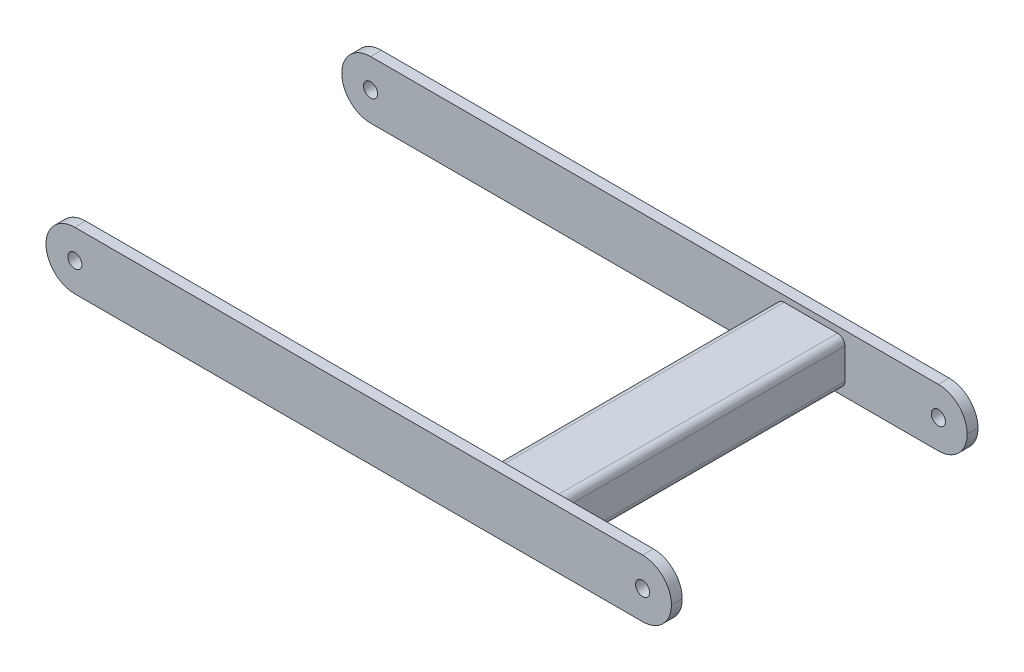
ISO-10303-21;
HEADER;
FILE_DESCRIPTION(('STEP AP214'),'2;1');
FILE_NAME('part.step','',(''),(''),'','','');
FILE_SCHEMA(('AUTOMOTIVE_DESIGN { 1 0 10303 214 1 1 1 1 }'));
ENDSEC;
DATA;
#1=APPLICATION_CONTEXT('core data for automotive mechanical design processes');
#2=APPLICATION_PROTOCOL_DEFINITION('international standard','automotive_design',2000,#1);
#3=PRODUCT_CONTEXT('',#1,'mechanical');
#4=PRODUCT('Part','Part','',(#3));
#5=PRODUCT_RELATED_PRODUCT_CATEGORY('part','',(#4));
#6=PRODUCT_DEFINITION_FORMATION('','',#4);
#7=PRODUCT_DEFINITION_CONTEXT('part definition',#1,'design');
#8=PRODUCT_DEFINITION('design','',#6,#7);
#9=PRODUCT_DEFINITION_SHAPE('','',#8);
#10=(LENGTH_UNIT() NAMED_UNIT(*) SI_UNIT(.MILLI.,.METRE.));
#11=(NAMED_UNIT(*) PLANE_ANGLE_UNIT() SI_UNIT($,.RADIAN.));
#12=(NAMED_UNIT(*) SI_UNIT($,.STERADIAN.) SOLID_ANGLE_UNIT());
#13=UNCERTAINTY_MEASURE_WITH_UNIT(LENGTH_MEASURE(1.E-05),#10,'distance_accuracy_value','');
#14=(GEOMETRIC_REPRESENTATION_CONTEXT(3) GLOBAL_UNCERTAINTY_ASSIGNED_CONTEXT((#13)) GLOBAL_UNIT_ASSIGNED_CONTEXT((#10,
#11,#12)) REPRESENTATION_CONTEXT('',''));
#15=CARTESIAN_POINT('',(0.,0.,0.));
#16=DIRECTION('',(0.,0.,1.));
#17=DIRECTION('',(1.,0.,0.));
#18=AXIS2_PLACEMENT_3D('',#15,#16,#17);
#19=CARTESIAN_POINT('',(389.5,13.5999999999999,125.475));
#20=DIRECTION('',(0.,0.,-1.));
#21=DIRECTION('',(-1.,0.,0.));
#22=AXIS2_PLACEMENT_3D('',#19,#20,#21);
#23=CYLINDRICAL_SURFACE('',#22,6.40000000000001);
#24=CARTESIAN_POINT('',(389.5,13.5999999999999,-125.475));
#25=DIRECTION('',(0.,0.,1.));
#26=DIRECTION('',(0.,1.,0.));
#27=AXIS2_PLACEMENT_3D('',#24,#25,#26);
#28=CIRCLE('',#27,6.40000000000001);
#29=CARTESIAN_POINT('',(389.5,20.,-125.475));
#30=VERTEX_POINT('',#29);
#31=CARTESIAN_POINT('',(383.1,13.5999999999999,-125.475));
#32=VERTEX_POINT('',#31);
#33=EDGE_CURVE('E247',#30,#32,#28,.T.);
#34=ORIENTED_EDGE('',*,*,#33,.T.);
#35=DIRECTION('',(0.,0.,-1.));
#36=VECTOR('',#35,1.);
#37=CARTESIAN_POINT('',(383.1,13.5999999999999,125.475));
#38=LINE('',#37,#36);
#39=CARTESIAN_POINT('',(383.1,13.5999999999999,125.475));
#40=VERTEX_POINT('',#39);
#41=EDGE_CURVE('E13',#40,#32,#38,.T.);
#42=ORIENTED_EDGE('',*,*,#41,.F.);
#43=CARTESIAN_POINT('',(389.5,13.5999999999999,125.475));
#44=DIRECTION('',(0.,0.,1.));
#45=DIRECTION('',(0.,1.,0.));
#46=AXIS2_PLACEMENT_3D('',#43,#44,#45);
#47=CIRCLE('',#46,6.40000000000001);
#48=CARTESIAN_POINT('',(389.5,20.,125.475));
#49=VERTEX_POINT('',#48);
#50=EDGE_CURVE('E325',#49,#40,#47,.T.);
#51=ORIENTED_EDGE('',*,*,#50,.F.);
#52=DIRECTION('',(0.,0.,-1.));
#53=VECTOR('',#52,1.);
#54=CARTESIAN_POINT('',(389.5,20.,125.475));
#55=LINE('',#54,#53);
#56=EDGE_CURVE('E262',#49,#30,#55,.T.);
#57=ORIENTED_EDGE('',*,*,#56,.T.);
#58=EDGE_LOOP('',(#34,#42,#51,#57));
#59=FACE_BOUND('',#58,.T.);
#60=ADVANCED_FACE('F75',(#59),#23,.T.);
#61=CARTESIAN_POINT('',(383.1,13.5999999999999,125.475));
#62=DIRECTION('',(1.,0.,0.));
#63=DIRECTION('',(0.,1.,0.));
#64=AXIS2_PLACEMENT_3D('',#61,#62,#63);
#65=PLANE('',#64);
#66=DIRECTION('',(0.,-1.,0.));
#67=VECTOR('',#66,1.);
#68=CARTESIAN_POINT('',(383.1,13.5999999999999,-125.475));
#69=LINE('',#68,#67);
#70=CARTESIAN_POINT('',(383.1,-13.6000000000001,-125.475));
#71=VERTEX_POINT('',#70);
#72=EDGE_CURVE('E250',#32,#71,#69,.T.);
#73=ORIENTED_EDGE('',*,*,#72,.T.);
#74=DIRECTION('',(0.,0.,-1.));
#75=VECTOR('',#74,1.);
#76=CARTESIAN_POINT('',(383.1,-13.6000000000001,125.475));
#77=LINE('',#76,#75);
#78=CARTESIAN_POINT('',(383.1,-13.6000000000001,125.475));
#79=VERTEX_POINT('',#78);
#80=EDGE_CURVE('E85',#79,#71,#77,.T.);
#81=ORIENTED_EDGE('',*,*,#80,.F.);
#82=DIRECTION('',(0.,-1.,0.));
#83=VECTOR('',#82,1.);
#84=CARTESIAN_POINT('',(383.1,13.5999999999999,125.475));
#85=LINE('',#84,#83);
#86=EDGE_CURVE('E327',#40,#79,#85,.T.);
#87=ORIENTED_EDGE('',*,*,#86,.F.);
#88=ORIENTED_EDGE('',*,*,#41,.T.);
#89=EDGE_LOOP('',(#73,#81,#87,#88));
#90=FACE_BOUND('',#89,.T.);
#91=ADVANCED_FACE('F362',(#90),#65,.F.);
#92=CARTESIAN_POINT('',(389.5,-13.6000000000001,125.475));
#93=DIRECTION('',(0.,0.,-1.));
#94=DIRECTION('',(-1.,0.,0.));
#95=AXIS2_PLACEMENT_3D('',#92,#93,#94);
#96=CYLINDRICAL_SURFACE('',#95,6.40000000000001);
#97=CARTESIAN_POINT('',(389.5,-13.6000000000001,-125.475));
#98=DIRECTION('',(0.,0.,1.));
#99=DIRECTION('',(0.,1.,0.));
#100=AXIS2_PLACEMENT_3D('',#97,#98,#99);
#101=CIRCLE('',#100,6.40000000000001);
#102=CARTESIAN_POINT('',(389.5,-20.0000000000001,-125.475));
#103=VERTEX_POINT('',#102);
#104=EDGE_CURVE('E252',#71,#103,#101,.T.);
#105=ORIENTED_EDGE('',*,*,#104,.T.);
#106=DIRECTION('',(0.,0.,-1.));
#107=VECTOR('',#106,1.);
#108=CARTESIAN_POINT('',(389.5,-20.0000000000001,125.475));
#109=LINE('',#108,#107);
#110=CARTESIAN_POINT('',(389.5,-20.0000000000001,125.475));
#111=VERTEX_POINT('',#110);
#112=EDGE_CURVE('E269',#111,#103,#109,.T.);
#113=ORIENTED_EDGE('',*,*,#112,.F.);
#114=CARTESIAN_POINT('',(389.5,-13.6000000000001,125.475));
#115=DIRECTION('',(0.,0.,1.));
#116=DIRECTION('',(0.,1.,0.));
#117=AXIS2_PLACEMENT_3D('',#114,#115,#116);
#118=CIRCLE('',#117,6.40000000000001);
#119=EDGE_CURVE('E329',#79,#111,#118,.T.);
#120=ORIENTED_EDGE('',*,*,#119,.F.);
#121=ORIENTED_EDGE('',*,*,#80,.T.);
#122=EDGE_LOOP('',(#105,#113,#120,#121));
#123=FACE_BOUND('',#122,.T.);
#124=ADVANCED_FACE('F367',(#123),#96,.T.);
#125=CARTESIAN_POINT('',(436.7,-20.,125.475));
#126=DIRECTION('',(0.,1.,0.));
#127=DIRECTION('',(-1.,0.,0.));
#128=AXIS2_PLACEMENT_3D('',#125,#126,#127);
#129=PLANE('',#128);
#130=DIRECTION('',(1.,0.,0.));
#131=VECTOR('',#130,1.);
#132=CARTESIAN_POINT('',(436.7,-20.,-125.475));
#133=LINE('',#132,#131);
#134=CARTESIAN_POINT('',(436.7,-20.,-125.475));
#135=VERTEX_POINT('',#134);
#136=EDGE_CURVE('E254',#103,#135,#133,.T.);
#137=ORIENTED_EDGE('',*,*,#136,.T.);
#138=DIRECTION('',(0.,0.,-1.));
#139=VECTOR('',#138,1.);
#140=CARTESIAN_POINT('',(436.7,-20.,125.475));
#141=LINE('',#140,#139);
#142=CARTESIAN_POINT('',(436.7,-20.,125.475));
#143=VERTEX_POINT('',#142);
#144=EDGE_CURVE('E266',#143,#135,#141,.T.);
#145=ORIENTED_EDGE('',*,*,#144,.F.);
#146=DIRECTION('',(1.,0.,0.));
#147=VECTOR('',#146,1.);
#148=CARTESIAN_POINT('',(436.7,-20.,125.475));
#149=LINE('',#148,#147);
#150=EDGE_CURVE('E331',#111,#143,#149,.T.);
#151=ORIENTED_EDGE('',*,*,#150,.F.);
#152=ORIENTED_EDGE('',*,*,#112,.T.);
#153=EDGE_LOOP('',(#137,#145,#151,#152));
#154=FACE_BOUND('',#153,.T.);
#155=ADVANCED_FACE('F337',(#154),#129,.F.);
#156=CARTESIAN_POINT('',(436.7,-13.5999999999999,125.475));
#157=DIRECTION('',(0.,0.,-1.));
#158=DIRECTION('',(-1.,0.,0.));
#159=AXIS2_PLACEMENT_3D('',#156,#157,#158);
#160=CYLINDRICAL_SURFACE('',#159,6.40000000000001);
#161=CARTESIAN_POINT('',(436.7,-13.5999999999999,-125.475));
#162=DIRECTION('',(0.,0.,1.));
#163=DIRECTION('',(0.,1.,0.));
#164=AXIS2_PLACEMENT_3D('',#161,#162,#163);
#165=CIRCLE('',#164,6.40000000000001);
#166=CARTESIAN_POINT('',(443.1,-13.5999999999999,-125.475));
#167=VERTEX_POINT('',#166);
#168=EDGE_CURVE('E256',#135,#167,#165,.T.);
#169=ORIENTED_EDGE('',*,*,#168,.T.);
#170=DIRECTION('',(0.,0.,-1.));
#171=VECTOR('',#170,1.);
#172=CARTESIAN_POINT('',(443.1,-13.5999999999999,125.475));
#173=LINE('',#172,#171);
#174=CARTESIAN_POINT('',(443.1,-13.5999999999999,125.475));
#175=VERTEX_POINT('',#174);
#176=EDGE_CURVE('E214',#175,#167,#173,.T.);
#177=ORIENTED_EDGE('',*,*,#176,.F.);
#178=CARTESIAN_POINT('',(436.7,-13.5999999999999,125.475));
#179=DIRECTION('',(0.,0.,1.));
#180=DIRECTION('',(0.,1.,0.));
#181=AXIS2_PLACEMENT_3D('',#178,#179,#180);
#182=CIRCLE('',#181,6.40000000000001);
#183=EDGE_CURVE('E205',#143,#175,#182,.T.);
#184=ORIENTED_EDGE('',*,*,#183,.F.);
#185=ORIENTED_EDGE('',*,*,#144,.T.);
#186=EDGE_LOOP('',(#169,#177,#184,#185));
#187=FACE_BOUND('',#186,.T.);
#188=ADVANCED_FACE('F341',(#187),#160,.T.);
#189=CARTESIAN_POINT('',(443.1,-13.5999999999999,125.475));
#190=DIRECTION('',(-1.,0.,0.));
#191=DIRECTION('',(0.,-1.,0.));
#192=AXIS2_PLACEMENT_3D('',#189,#190,#191);
#193=PLANE('',#192);
#194=DIRECTION('',(0.,1.,0.));
#195=VECTOR('',#194,1.);
#196=CARTESIAN_POINT('',(443.1,-13.5999999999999,-125.475));
#197=LINE('',#196,#195);
#198=CARTESIAN_POINT('',(443.1,13.6000000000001,-125.475));
#199=VERTEX_POINT('',#198);
#200=EDGE_CURVE('E213',#167,#199,#197,.T.);
#201=ORIENTED_EDGE('',*,*,#200,.T.);
#202=DIRECTION('',(0.,0.,-1.));
#203=VECTOR('',#202,1.);
#204=CARTESIAN_POINT('',(443.1,13.6000000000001,125.475));
#205=LINE('',#204,#203);
#206=CARTESIAN_POINT('',(443.1,13.6000000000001,125.475));
#207=VERTEX_POINT('',#206);
#208=EDGE_CURVE('E210',#207,#199,#205,.T.);
#209=ORIENTED_EDGE('',*,*,#208,.F.);
#210=DIRECTION('',(0.,1.,0.));
#211=VECTOR('',#210,1.);
#212=CARTESIAN_POINT('',(443.1,-13.5999999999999,125.475));
#213=LINE('',#212,#211);
#214=EDGE_CURVE('E199',#175,#207,#213,.T.);
#215=ORIENTED_EDGE('',*,*,#214,.F.);
#216=ORIENTED_EDGE('',*,*,#176,.T.);
#217=EDGE_LOOP('',(#201,#209,#215,#216));
#218=FACE_BOUND('',#217,.T.);
#219=ADVANCED_FACE('F211',(#218),#193,.F.);
#220=CARTESIAN_POINT('',(436.7,13.6000000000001,125.475));
#221=DIRECTION('',(0.,0.,-1.));
#222=DIRECTION('',(-1.,0.,0.));
#223=AXIS2_PLACEMENT_3D('',#220,#221,#222);
#224=CYLINDRICAL_SURFACE('',#223,6.40000000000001);
#225=CARTESIAN_POINT('',(436.7,13.6000000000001,-125.475));
#226=DIRECTION('',(0.,0.,1.));
#227=DIRECTION('',(0.,1.,0.));
#228=AXIS2_PLACEMENT_3D('',#225,#226,#227);
#229=CIRCLE('',#228,6.40000000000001);
#230=CARTESIAN_POINT('',(436.7,20.0000000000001,-125.475));
#231=VERTEX_POINT('',#230);
#232=EDGE_CURVE('E147',#199,#231,#229,.T.);
#233=ORIENTED_EDGE('',*,*,#232,.T.);
#234=DIRECTION('',(0.,0.,-1.));
#235=VECTOR('',#234,1.);
#236=CARTESIAN_POINT('',(436.7,20.0000000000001,125.475));
#237=LINE('',#236,#235);
#238=CARTESIAN_POINT('',(436.7,20.0000000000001,125.475));
#239=VERTEX_POINT('',#238);
#240=EDGE_CURVE('E215',#239,#231,#237,.T.);
#241=ORIENTED_EDGE('',*,*,#240,.F.);
#242=CARTESIAN_POINT('',(436.7,13.6000000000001,125.475));
#243=DIRECTION('',(0.,0.,1.));
#244=DIRECTION('',(0.,1.,0.));
#245=AXIS2_PLACEMENT_3D('',#242,#243,#244);
#246=CIRCLE('',#245,6.40000000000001);
#247=EDGE_CURVE('E203',#207,#239,#246,.T.);
#248=ORIENTED_EDGE('',*,*,#247,.F.);
#249=ORIENTED_EDGE('',*,*,#208,.T.);
#250=EDGE_LOOP('',(#233,#241,#248,#249));
#251=FACE_BOUND('',#250,.T.);
#252=ADVANCED_FACE('F217',(#251),#224,.T.);
#253=CARTESIAN_POINT('',(389.5,-13.6000000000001,125.475));
#254=DIRECTION('',(0.,0.,-1.));
#255=DIRECTION('',(-1.,0.,0.));
#256=AXIS2_PLACEMENT_3D('',#253,#254,#255);
#257=CYLINDRICAL_SURFACE('',#256,3.19999999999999);
#258=CARTESIAN_POINT('',(389.5,-13.6000000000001,-125.475));
#259=DIRECTION('',(0.,0.,1.));
#260=DIRECTION('',(0.,1.,0.));
#261=AXIS2_PLACEMENT_3D('',#258,#259,#260);
#262=CIRCLE('',#261,3.19999999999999);
#263=CARTESIAN_POINT('',(386.3,-13.6000000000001,-125.475));
#264=VERTEX_POINT('',#263);
#265=CARTESIAN_POINT('',(389.5,-16.8,-125.475));
#266=VERTEX_POINT('',#265);
#267=EDGE_CURVE('E223',#264,#266,#262,.T.);
#268=ORIENTED_EDGE('',*,*,#267,.F.);
#269=DIRECTION('',(0.,0.,-1.));
#270=VECTOR('',#269,1.);
#271=CARTESIAN_POINT('',(386.3,-13.6000000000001,125.475));
#272=LINE('',#271,#270);
#273=CARTESIAN_POINT('',(386.3,-13.6000000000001,125.475));
#274=VERTEX_POINT('',#273);
#275=EDGE_CURVE('E79',#274,#264,#272,.T.);
#276=ORIENTED_EDGE('',*,*,#275,.F.);
#277=CARTESIAN_POINT('',(389.5,-13.6000000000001,125.475));
#278=DIRECTION('',(0.,0.,1.));
#279=DIRECTION('',(0.,1.,0.));
#280=AXIS2_PLACEMENT_3D('',#277,#278,#279);
#281=CIRCLE('',#280,3.19999999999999);
#282=CARTESIAN_POINT('',(389.5,-16.8,125.475));
#283=VERTEX_POINT('',#282);
#284=EDGE_CURVE('E261',#274,#283,#281,.T.);
#285=ORIENTED_EDGE('',*,*,#284,.T.);
#286=DIRECTION('',(0.,0.,-1.));
#287=VECTOR('',#286,1.);
#288=CARTESIAN_POINT('',(389.5,-16.8,125.475));
#289=LINE('',#288,#287);
#290=EDGE_CURVE('E219',#283,#266,#289,.T.);
#291=ORIENTED_EDGE('',*,*,#290,.T.);
#292=EDGE_LOOP('',(#268,#276,#285,#291));
#293=FACE_BOUND('',#292,.T.);
#294=ADVANCED_FACE('F77',(#293),#257,.F.);
#295=CARTESIAN_POINT('',(386.3,13.5999999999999,125.475));
#296=DIRECTION('',(1.,0.,0.));
#297=DIRECTION('',(0.,1.,0.));
#298=AXIS2_PLACEMENT_3D('',#295,#296,#297);
#299=PLANE('',#298);
#300=DIRECTION('',(0.,-1.,0.));
#301=VECTOR('',#300,1.);
#302=CARTESIAN_POINT('',(386.3,13.5999999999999,-125.475));
#303=LINE('',#302,#301);
#304=CARTESIAN_POINT('',(386.3,13.5999999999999,-125.475));
#305=VERTEX_POINT('',#304);
#306=EDGE_CURVE('E226',#305,#264,#303,.T.);
#307=ORIENTED_EDGE('',*,*,#306,.F.);
#308=DIRECTION('',(0.,0.,-1.));
#309=VECTOR('',#308,1.);
#310=CARTESIAN_POINT('',(386.3,13.5999999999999,125.475));
#311=LINE('',#310,#309);
#312=CARTESIAN_POINT('',(386.3,13.5999999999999,125.475));
#313=VERTEX_POINT('',#312);
#314=EDGE_CURVE('E284',#313,#305,#311,.T.);
#315=ORIENTED_EDGE('',*,*,#314,.F.);
#316=DIRECTION('',(0.,-1.,0.));
#317=VECTOR('',#316,1.);
#318=CARTESIAN_POINT('',(386.3,13.5999999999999,125.475));
#319=LINE('',#318,#317);
#320=EDGE_CURVE('E293',#313,#274,#319,.T.);
#321=ORIENTED_EDGE('',*,*,#320,.T.);
#322=ORIENTED_EDGE('',*,*,#275,.T.);
#323=EDGE_LOOP('',(#307,#315,#321,#322));
#324=FACE_BOUND('',#323,.T.);
#325=ADVANCED_FACE('F291',(#324),#299,.T.);
#326=CARTESIAN_POINT('',(389.5,13.5999999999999,125.475));
#327=DIRECTION('',(0.,0.,-1.));
#328=DIRECTION('',(-1.,0.,0.));
#329=AXIS2_PLACEMENT_3D('',#326,#327,#328);
#330=CYLINDRICAL_SURFACE('',#329,3.20000000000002);
#331=CARTESIAN_POINT('',(389.5,13.5999999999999,-125.475));
#332=DIRECTION('',(0.,0.,1.));
#333=DIRECTION('',(0.,1.,0.));
#334=AXIS2_PLACEMENT_3D('',#331,#332,#333);
#335=CIRCLE('',#334,3.20000000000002);
#336=CARTESIAN_POINT('',(389.5,16.8,-125.475));
#337=VERTEX_POINT('',#336);
#338=EDGE_CURVE('E229',#337,#305,#335,.T.);
#339=ORIENTED_EDGE('',*,*,#338,.F.);
#340=DIRECTION('',(0.,0.,-1.));
#341=VECTOR('',#340,1.);
#342=CARTESIAN_POINT('',(389.5,16.8,125.475));
#343=LINE('',#342,#341);
#344=CARTESIAN_POINT('',(389.5,16.8,125.475));
#345=VERTEX_POINT('',#344);
#346=EDGE_CURVE('E283',#345,#337,#343,.T.);
#347=ORIENTED_EDGE('',*,*,#346,.F.);
#348=CARTESIAN_POINT('',(389.5,13.5999999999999,125.475));
#349=DIRECTION('',(0.,0.,1.));
#350=DIRECTION('',(0.,1.,0.));
#351=AXIS2_PLACEMENT_3D('',#348,#349,#350);
#352=CIRCLE('',#351,3.20000000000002);
#353=EDGE_CURVE('E301',#345,#313,#352,.T.);
#354=ORIENTED_EDGE('',*,*,#353,.T.);
#355=ORIENTED_EDGE('',*,*,#314,.T.);
#356=EDGE_LOOP('',(#339,#347,#354,#355));
#357=FACE_BOUND('',#356,.T.);
#358=ADVANCED_FACE('F299',(#357),#330,.F.);
#359=CARTESIAN_POINT('',(389.5,16.8,125.475));
#360=DIRECTION('',(0.,-1.,0.));
#361=DIRECTION('',(1.,0.,0.));
#362=AXIS2_PLACEMENT_3D('',#359,#360,#361);
#363=PLANE('',#362);
#364=DIRECTION('',(-1.,0.,0.));
#365=VECTOR('',#364,1.);
#366=CARTESIAN_POINT('',(389.5,16.8,-125.475));
#367=LINE('',#366,#365);
#368=CARTESIAN_POINT('',(436.7,16.8000000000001,-125.475));
#369=VERTEX_POINT('',#368);
#370=EDGE_CURVE('E232',#369,#337,#367,.T.);
#371=ORIENTED_EDGE('',*,*,#370,.F.);
#372=DIRECTION('',(0.,0.,-1.));
#373=VECTOR('',#372,1.);
#374=CARTESIAN_POINT('',(436.7,16.8000000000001,125.475));
#375=LINE('',#374,#373);
#376=CARTESIAN_POINT('',(436.7,16.8000000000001,125.475));
#377=VERTEX_POINT('',#376);
#378=EDGE_CURVE('E281',#377,#369,#375,.T.);
#379=ORIENTED_EDGE('',*,*,#378,.F.);
#380=DIRECTION('',(-1.,0.,0.));
#381=VECTOR('',#380,1.);
#382=CARTESIAN_POINT('',(389.5,16.8,125.475));
#383=LINE('',#382,#381);
#384=EDGE_CURVE('E307',#377,#345,#383,.T.);
#385=ORIENTED_EDGE('',*,*,#384,.T.);
#386=ORIENTED_EDGE('',*,*,#346,.T.);
#387=EDGE_LOOP('',(#371,#379,#385,#386));
#388=FACE_BOUND('',#387,.T.);
#389=ADVANCED_FACE('F310',(#388),#363,.T.);
#390=CARTESIAN_POINT('',(436.7,13.6000000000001,125.475));
#391=DIRECTION('',(0.,0.,-1.));
#392=DIRECTION('',(-1.,0.,0.));
#393=AXIS2_PLACEMENT_3D('',#390,#391,#392);
#394=CYLINDRICAL_SURFACE('',#393,3.20000000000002);
#395=CARTESIAN_POINT('',(436.7,13.6000000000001,-125.475));
#396=DIRECTION('',(0.,0.,1.));
#397=DIRECTION('',(0.,1.,0.));
#398=AXIS2_PLACEMENT_3D('',#395,#396,#397);
#399=CIRCLE('',#398,3.20000000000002);
#400=CARTESIAN_POINT('',(439.9,13.6000000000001,-125.475));
#401=VERTEX_POINT('',#400);
#402=EDGE_CURVE('E235',#401,#369,#399,.T.);
#403=ORIENTED_EDGE('',*,*,#402,.F.);
#404=DIRECTION('',(0.,0.,-1.));
#405=VECTOR('',#404,1.);
#406=CARTESIAN_POINT('',(439.9,13.6000000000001,125.475));
#407=LINE('',#406,#405);
#408=CARTESIAN_POINT('',(439.9,13.6000000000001,125.475));
#409=VERTEX_POINT('',#408);
#410=EDGE_CURVE('E279',#409,#401,#407,.T.);
#411=ORIENTED_EDGE('',*,*,#410,.F.);
#412=CARTESIAN_POINT('',(436.7,13.6000000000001,125.475));
#413=DIRECTION('',(0.,0.,1.));
#414=DIRECTION('',(0.,1.,0.));
#415=AXIS2_PLACEMENT_3D('',#412,#413,#414);
#416=CIRCLE('',#415,3.20000000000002);
#417=EDGE_CURVE('E311',#409,#377,#416,.T.);
#418=ORIENTED_EDGE('',*,*,#417,.T.);
#419=ORIENTED_EDGE('',*,*,#378,.T.);
#420=EDGE_LOOP('',(#403,#411,#418,#419));
#421=FACE_BOUND('',#420,.T.);
#422=ADVANCED_FACE('F378',(#421),#394,.F.);
#423=CARTESIAN_POINT('',(439.9,-13.5999999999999,125.475));
#424=DIRECTION('',(-1.,0.,0.));
#425=DIRECTION('',(0.,-1.,0.));
#426=AXIS2_PLACEMENT_3D('',#423,#424,#425);
#427=PLANE('',#426);
#428=DIRECTION('',(0.,1.,0.));
#429=VECTOR('',#428,1.);
#430=CARTESIAN_POINT('',(439.9,-13.5999999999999,-125.475));
#431=LINE('',#430,#429);
#432=CARTESIAN_POINT('',(439.9,-13.5999999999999,-125.475));
#433=VERTEX_POINT('',#432);
#434=EDGE_CURVE('E238',#433,#401,#431,.T.);
#435=ORIENTED_EDGE('',*,*,#434,.F.);
#436=DIRECTION('',(0.,0.,-1.));
#437=VECTOR('',#436,1.);
#438=CARTESIAN_POINT('',(439.9,-13.5999999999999,125.475));
#439=LINE('',#438,#437);
#440=CARTESIAN_POINT('',(439.9,-13.5999999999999,125.475));
#441=VERTEX_POINT('',#440);
#442=EDGE_CURVE('E277',#441,#433,#439,.T.);
#443=ORIENTED_EDGE('',*,*,#442,.F.);
#444=DIRECTION('',(0.,1.,0.));
#445=VECTOR('',#444,1.);
#446=CARTESIAN_POINT('',(439.9,-13.5999999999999,125.475));
#447=LINE('',#446,#445);
#448=EDGE_CURVE('E313',#441,#409,#447,.T.);
#449=ORIENTED_EDGE('',*,*,#448,.T.);
#450=ORIENTED_EDGE('',*,*,#410,.T.);
#451=EDGE_LOOP('',(#435,#443,#449,#450));
#452=FACE_BOUND('',#451,.T.);
#453=ADVANCED_FACE('F374',(#452),#427,.T.);
#454=CARTESIAN_POINT('',(436.7,-13.5999999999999,125.475));
#455=DIRECTION('',(0.,0.,-1.));
#456=DIRECTION('',(-1.,0.,0.));
#457=AXIS2_PLACEMENT_3D('',#454,#455,#456);
#458=CYLINDRICAL_SURFACE('',#457,3.19999999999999);
#459=CARTESIAN_POINT('',(436.7,-13.5999999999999,-125.475));
#460=DIRECTION('',(0.,0.,1.));
#461=DIRECTION('',(0.,1.,0.));
#462=AXIS2_PLACEMENT_3D('',#459,#460,#461);
#463=CIRCLE('',#462,3.19999999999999);
#464=CARTESIAN_POINT('',(436.7,-16.7999999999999,-125.475));
#465=VERTEX_POINT('',#464);
#466=EDGE_CURVE('E241',#465,#433,#463,.T.);
#467=ORIENTED_EDGE('',*,*,#466,.F.);
#468=DIRECTION('',(0.,0.,-1.));
#469=VECTOR('',#468,1.);
#470=CARTESIAN_POINT('',(436.7,-16.7999999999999,125.475));
#471=LINE('',#470,#469);
#472=CARTESIAN_POINT('',(436.7,-16.7999999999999,125.475));
#473=VERTEX_POINT('',#472);
#474=EDGE_CURVE('E275',#473,#465,#471,.T.);
#475=ORIENTED_EDGE('',*,*,#474,.F.);
#476=CARTESIAN_POINT('',(436.7,-13.5999999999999,125.475));
#477=DIRECTION('',(0.,0.,1.));
#478=DIRECTION('',(0.,1.,0.));
#479=AXIS2_PLACEMENT_3D('',#476,#477,#478);
#480=CIRCLE('',#479,3.19999999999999);
#481=EDGE_CURVE('E319',#473,#441,#480,.T.);
#482=ORIENTED_EDGE('',*,*,#481,.T.);
#483=ORIENTED_EDGE('',*,*,#442,.T.);
#484=EDGE_LOOP('',(#467,#475,#482,#483));
#485=FACE_BOUND('',#484,.T.);
#486=ADVANCED_FACE('F356',(#485),#458,.F.);
#487=CARTESIAN_POINT('',(436.7,-16.7999999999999,125.475));
#488=DIRECTION('',(0.,1.,0.));
#489=DIRECTION('',(-1.,0.,0.));
#490=AXIS2_PLACEMENT_3D('',#487,#488,#489);
#491=PLANE('',#490);
#492=DIRECTION('',(1.,0.,0.));
#493=VECTOR('',#492,1.);
#494=CARTESIAN_POINT('',(436.7,-16.7999999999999,-125.475));
#495=LINE('',#494,#493);
#496=EDGE_CURVE('E244',#266,#465,#495,.T.);
#497=ORIENTED_EDGE('',*,*,#496,.F.);
#498=ORIENTED_EDGE('',*,*,#290,.F.);
#499=DIRECTION('',(1.,0.,0.));
#500=VECTOR('',#499,1.);
#501=CARTESIAN_POINT('',(436.7,-16.7999999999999,125.475));
#502=LINE('',#501,#500);
#503=EDGE_CURVE('E322',#283,#473,#502,.T.);
#504=ORIENTED_EDGE('',*,*,#503,.T.);
#505=ORIENTED_EDGE('',*,*,#474,.T.);
#506=EDGE_LOOP('',(#497,#498,#504,#505));
#507=FACE_BOUND('',#506,.T.);
#508=ADVANCED_FACE('F349',(#507),#491,.T.);
#509=CARTESIAN_POINT('',(389.5,20.,125.475));
#510=DIRECTION('',(0.,-1.,0.));
#511=DIRECTION('',(1.,0.,0.));
#512=AXIS2_PLACEMENT_3D('',#509,#510,#511);
#513=PLANE('',#512);
#514=DIRECTION('',(-1.,0.,0.));
#515=VECTOR('',#514,1.);
#516=CARTESIAN_POINT('',(389.5,20.,-125.475));
#517=LINE('',#516,#515);
#518=EDGE_CURVE('E153',#231,#30,#517,.T.);
#519=ORIENTED_EDGE('',*,*,#518,.T.);
#520=ORIENTED_EDGE('',*,*,#56,.F.);
#521=DIRECTION('',(-1.,0.,0.));
#522=VECTOR('',#521,1.);
#523=CARTESIAN_POINT('',(389.5,20.,125.475));
#524=LINE('',#523,#522);
#525=EDGE_CURVE('E94',#239,#49,#524,.T.);
#526=ORIENTED_EDGE('',*,*,#525,.F.);
#527=ORIENTED_EDGE('',*,*,#240,.T.);
#528=EDGE_LOOP('',(#519,#520,#526,#527));
#529=FACE_BOUND('',#528,.T.);
#530=ADVANCED_FACE('F347',(#529),#513,.F.);
#531=CARTESIAN_POINT('',(389.5,13.5999999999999,125.475));
#532=DIRECTION('',(0.,0.,1.));
#533=DIRECTION('',(0.,1.,0.));
#534=AXIS2_PLACEMENT_3D('',#531,#532,#533);
#535=PLANE('',#534);
#536=ORIENTED_EDGE('',*,*,#284,.F.);
#537=ORIENTED_EDGE('',*,*,#320,.F.);
#538=ORIENTED_EDGE('',*,*,#353,.F.);
#539=ORIENTED_EDGE('',*,*,#384,.F.);
#540=ORIENTED_EDGE('',*,*,#417,.F.);
#541=ORIENTED_EDGE('',*,*,#448,.F.);
#542=ORIENTED_EDGE('',*,*,#481,.F.);
#543=ORIENTED_EDGE('',*,*,#503,.F.);
#544=EDGE_LOOP('',(#536,#537,#538,#539,#540,#541,#542,#543));
#545=FACE_BOUND('',#544,.T.);
#546=ORIENTED_EDGE('',*,*,#50,.T.);
#547=ORIENTED_EDGE('',*,*,#86,.T.);
#548=ORIENTED_EDGE('',*,*,#119,.T.);
#549=ORIENTED_EDGE('',*,*,#150,.T.);
#550=ORIENTED_EDGE('',*,*,#183,.T.);
#551=ORIENTED_EDGE('',*,*,#214,.T.);
#552=ORIENTED_EDGE('',*,*,#247,.T.);
#553=ORIENTED_EDGE('',*,*,#525,.T.);
#554=EDGE_LOOP('',(#546,#547,#548,#549,#550,#551,#552,#553));
#555=FACE_BOUND('',#554,.T.);
#556=ADVANCED_FACE('F201',(#545,#555),#535,.T.);
#557=CARTESIAN_POINT('',(389.5,13.5999999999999,-125.475));
#558=DIRECTION('',(0.,0.,1.));
#559=DIRECTION('',(0.,1.,0.));
#560=AXIS2_PLACEMENT_3D('',#557,#558,#559);
#561=PLANE('',#560);
#562=ORIENTED_EDGE('',*,*,#267,.T.);
#563=ORIENTED_EDGE('',*,*,#496,.T.);
#564=ORIENTED_EDGE('',*,*,#466,.T.);
#565=ORIENTED_EDGE('',*,*,#434,.T.);
#566=ORIENTED_EDGE('',*,*,#402,.T.);
#567=ORIENTED_EDGE('',*,*,#370,.T.);
#568=ORIENTED_EDGE('',*,*,#338,.T.);
#569=ORIENTED_EDGE('',*,*,#306,.T.);
#570=EDGE_LOOP('',(#562,#563,#564,#565,#566,#567,#568,#569));
#571=FACE_BOUND('',#570,.T.);
#572=ORIENTED_EDGE('',*,*,#33,.F.);
#573=ORIENTED_EDGE('',*,*,#518,.F.);
#574=ORIENTED_EDGE('',*,*,#232,.F.);
#575=ORIENTED_EDGE('',*,*,#200,.F.);
#576=ORIENTED_EDGE('',*,*,#168,.F.);
#577=ORIENTED_EDGE('',*,*,#136,.F.);
#578=ORIENTED_EDGE('',*,*,#104,.F.);
#579=ORIENTED_EDGE('',*,*,#72,.F.);
#580=EDGE_LOOP('',(#572,#573,#574,#575,#576,#577,#578,#579));
#581=FACE_BOUND('',#580,.T.);
#582=ADVANCED_FACE('F296',(#571,#581),#561,.F.);
#583=CLOSED_SHELL('',(#60,#91,#124,#155,#188,#219,#252,#294,#325,#358,#389,#422,#453,#486,#508,
#530,#556,#582));
#584=MANIFOLD_SOLID_BREP('B2',#583);
#585=CARTESIAN_POINT('',(550.8,25.4000000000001,135.));
#586=DIRECTION('',(0.,0.,-1.));
#587=DIRECTION('',(0.,-1.,0.));
#588=AXIS2_PLACEMENT_3D('',#585,#586,#587);
#589=PLANE('',#588);
#590=CARTESIAN_POINT('',(25.4,0.,135.));
#591=DIRECTION('',(0.,0.,1.));
#592=DIRECTION('',(1.,0.,0.));
#593=AXIS2_PLACEMENT_3D('',#590,#591,#592);
#594=CIRCLE('',#593,6.24999999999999);
#595=CARTESIAN_POINT('',(31.65,0.,135.));
#596=VERTEX_POINT('',#595);
#597=EDGE_CURVE('E674',#596,#596,#594,.T.);
#598=ORIENTED_EDGE('',*,*,#597,.F.);
#599=EDGE_LOOP('',(#598));
#600=FACE_BOUND('',#599,.T.);
#601=DIRECTION('',(-1.,0.,0.));
#602=VECTOR('',#601,1.);
#603=CARTESIAN_POINT('',(550.8,-25.3999999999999,135.));
#604=LINE('',#603,#602);
#605=CARTESIAN_POINT('',(525.4,-25.3999999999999,135.));
#606=VERTEX_POINT('',#605);
#607=CARTESIAN_POINT('',(25.4,-25.3999999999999,135.));
#608=VERTEX_POINT('',#607);
#609=EDGE_CURVE('E616',#606,#608,#604,.T.);
#610=ORIENTED_EDGE('',*,*,#609,.F.);
#611=CARTESIAN_POINT('',(525.4,0.,135.));
#612=DIRECTION('',(0.,0.,1.));
#613=DIRECTION('',(0.,-1.,0.));
#614=AXIS2_PLACEMENT_3D('',#611,#612,#613);
#615=CIRCLE('',#614,25.4);
#616=CARTESIAN_POINT('',(550.8,0.,135.));
#617=VERTEX_POINT('',#616);
#618=EDGE_CURVE('E626',#617,#606,#615,.F.);
#619=ORIENTED_EDGE('',*,*,#618,.F.);
#620=CARTESIAN_POINT('',(525.4,0.,135.));
#621=DIRECTION('',(0.,0.,1.));
#622=DIRECTION('',(0.,-1.,0.));
#623=AXIS2_PLACEMENT_3D('',#620,#621,#622);
#624=CIRCLE('',#623,25.4);
#625=CARTESIAN_POINT('',(525.4,25.4000000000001,135.));
#626=VERTEX_POINT('',#625);
#627=EDGE_CURVE('E633',#626,#617,#624,.F.);
#628=ORIENTED_EDGE('',*,*,#627,.F.);
#629=DIRECTION('',(-1.,0.,0.));
#630=VECTOR('',#629,1.);
#631=CARTESIAN_POINT('',(550.8,25.4000000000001,135.));
#632=LINE('',#631,#630);
#633=CARTESIAN_POINT('',(25.4,25.4000000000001,135.));
#634=VERTEX_POINT('',#633);
#635=EDGE_CURVE('E623',#626,#634,#632,.T.);
#636=ORIENTED_EDGE('',*,*,#635,.T.);
#637=CARTESIAN_POINT('',(25.4,0.,135.));
#638=DIRECTION('',(0.,0.,1.));
#639=DIRECTION('',(0.,-1.,0.));
#640=AXIS2_PLACEMENT_3D('',#637,#638,#639);
#641=CIRCLE('',#640,25.4);
#642=CARTESIAN_POINT('',(0.,0.,135.));
#643=VERTEX_POINT('',#642);
#644=EDGE_CURVE('E632',#643,#634,#641,.F.);
#645=ORIENTED_EDGE('',*,*,#644,.F.);
#646=CARTESIAN_POINT('',(25.4,0.,135.));
#647=DIRECTION('',(0.,0.,1.));
#648=DIRECTION('',(0.,-1.,0.));
#649=AXIS2_PLACEMENT_3D('',#646,#647,#648);
#650=CIRCLE('',#649,25.4);
#651=EDGE_CURVE('E639',#608,#643,#650,.F.);
#652=ORIENTED_EDGE('',*,*,#651,.F.);
#653=EDGE_LOOP('',(#610,#619,#628,#636,#645,#652));
#654=FACE_BOUND('',#653,.T.);
#655=CARTESIAN_POINT('',(525.4,0.,135.));
#656=DIRECTION('',(0.,0.,1.));
#657=DIRECTION('',(1.,0.,0.));
#658=AXIS2_PLACEMENT_3D('',#655,#656,#657);
#659=CIRCLE('',#658,6.24999999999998);
#660=CARTESIAN_POINT('',(531.65,0.,135.));
#661=VERTEX_POINT('',#660);
#662=EDGE_CURVE('E646',#661,#661,#659,.T.);
#663=ORIENTED_EDGE('',*,*,#662,.F.);
#664=EDGE_LOOP('',(#663));
#665=FACE_BOUND('',#664,.T.);
#666=ADVANCED_FACE('F557',(#600,#654,#665),#589,.F.);
#667=CARTESIAN_POINT('',(550.8,25.4000000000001,125.475));
#668=DIRECTION('',(0.,-1.,0.));
#669=DIRECTION('',(0.,0.,1.));
#670=AXIS2_PLACEMENT_3D('',#667,#668,#669);
#671=PLANE('',#670);
#672=ORIENTED_EDGE('',*,*,#635,.F.);
#673=DIRECTION('',(0.,0.,-1.));
#674=VECTOR('',#673,1.);
#675=CARTESIAN_POINT('',(525.4,25.4000000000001,135.));
#676=LINE('',#675,#674);
#677=CARTESIAN_POINT('',(525.4,25.4000000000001,125.475));
#678=VERTEX_POINT('',#677);
#679=EDGE_CURVE('E566',#678,#626,#676,.F.);
#680=ORIENTED_EDGE('',*,*,#679,.F.);
#681=DIRECTION('',(-1.,0.,0.));
#682=VECTOR('',#681,1.);
#683=CARTESIAN_POINT('',(550.8,25.4000000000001,125.475));
#684=LINE('',#683,#682);
#685=CARTESIAN_POINT('',(25.4,25.4000000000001,125.475));
#686=VERTEX_POINT('',#685);
#687=EDGE_CURVE('E642',#678,#686,#684,.T.);
#688=ORIENTED_EDGE('',*,*,#687,.T.);
#689=DIRECTION('',(0.,0.,-1.));
#690=VECTOR('',#689,1.);
#691=CARTESIAN_POINT('',(25.4,25.4000000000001,125.475));
#692=LINE('',#691,#690);
#693=EDGE_CURVE('E73',#634,#686,#692,.T.);
#694=ORIENTED_EDGE('',*,*,#693,.F.);
#695=EDGE_LOOP('',(#672,#680,#688,#694));
#696=FACE_BOUND('',#695,.T.);
#697=ADVANCED_FACE('F684',(#696),#671,.F.);
#698=CARTESIAN_POINT('',(550.8,25.4000000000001,125.475));
#699=DIRECTION('',(0.,0.,1.));
#700=DIRECTION('',(-1.,0.,0.));
#701=AXIS2_PLACEMENT_3D('',#698,#699,#700);
#702=PLANE('',#701);
#703=CARTESIAN_POINT('',(25.4,0.,125.475));
#704=DIRECTION('',(0.,0.,1.));
#705=DIRECTION('',(1.,0.,0.));
#706=AXIS2_PLACEMENT_3D('',#703,#704,#705);
#707=CIRCLE('',#706,6.24999999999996);
#708=CARTESIAN_POINT('',(31.6499999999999,0.,125.475));
#709=VERTEX_POINT('',#708);
#710=EDGE_CURVE('E561',#709,#709,#707,.T.);
#711=ORIENTED_EDGE('',*,*,#710,.T.);
#712=EDGE_LOOP('',(#711));
#713=FACE_BOUND('',#712,.T.);
#714=CARTESIAN_POINT('',(525.4,0.,125.475));
#715=DIRECTION('',(0.,0.,1.));
#716=DIRECTION('',(1.,0.,0.));
#717=AXIS2_PLACEMENT_3D('',#714,#715,#716);
#718=CIRCLE('',#717,6.24999999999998);
#719=CARTESIAN_POINT('',(531.65,0.,125.475));
#720=VERTEX_POINT('',#719);
#721=EDGE_CURVE('E666',#720,#720,#718,.T.);
#722=ORIENTED_EDGE('',*,*,#721,.T.);
#723=EDGE_LOOP('',(#722));
#724=FACE_BOUND('',#723,.T.);
#725=CARTESIAN_POINT('',(25.4,0.,125.475));
#726=DIRECTION('',(0.,0.,-1.));
#727=DIRECTION('',(-1.,0.,0.));
#728=AXIS2_PLACEMENT_3D('',#725,#726,#727);
#729=CIRCLE('',#728,25.4);
#730=CARTESIAN_POINT('',(0.,0.,125.475));
#731=VERTEX_POINT('',#730);
#732=EDGE_CURVE('E574',#686,#731,#729,.F.);
#733=ORIENTED_EDGE('',*,*,#732,.F.);
#734=ORIENTED_EDGE('',*,*,#687,.F.);
#735=CARTESIAN_POINT('',(525.4,0.,125.475));
#736=DIRECTION('',(0.,0.,-1.));
#737=DIRECTION('',(-1.,0.,0.));
#738=AXIS2_PLACEMENT_3D('',#735,#736,#737);
#739=CIRCLE('',#738,25.4);
#740=CARTESIAN_POINT('',(550.8,0.,125.475));
#741=VERTEX_POINT('',#740);
#742=EDGE_CURVE('E581',#741,#678,#739,.F.);
#743=ORIENTED_EDGE('',*,*,#742,.F.);
#744=CARTESIAN_POINT('',(525.4,0.,125.475));
#745=DIRECTION('',(0.,0.,-1.));
#746=DIRECTION('',(-1.,0.,0.));
#747=AXIS2_PLACEMENT_3D('',#744,#745,#746);
#748=CIRCLE('',#747,25.4);
#749=CARTESIAN_POINT('',(525.4,-25.3999999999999,125.475));
#750=VERTEX_POINT('',#749);
#751=EDGE_CURVE('E659',#750,#741,#748,.F.);
#752=ORIENTED_EDGE('',*,*,#751,.F.);
#753=DIRECTION('',(-1.,0.,0.));
#754=VECTOR('',#753,1.);
#755=CARTESIAN_POINT('',(550.8,-25.3999999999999,125.475));
#756=LINE('',#755,#754);
#757=CARTESIAN_POINT('',(25.4,-25.3999999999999,125.475));
#758=VERTEX_POINT('',#757);
#759=EDGE_CURVE('E618',#750,#758,#756,.T.);
#760=ORIENTED_EDGE('',*,*,#759,.T.);
#761=CARTESIAN_POINT('',(25.4,0.,125.475));
#762=DIRECTION('',(0.,0.,-1.));
#763=DIRECTION('',(-1.,0.,0.));
#764=AXIS2_PLACEMENT_3D('',#761,#762,#763);
#765=CIRCLE('',#764,25.4);
#766=EDGE_CURVE('E662',#731,#758,#765,.F.);
#767=ORIENTED_EDGE('',*,*,#766,.F.);
#768=EDGE_LOOP('',(#733,#734,#743,#752,#760,#767));
#769=FACE_BOUND('',#768,.T.);
#770=ADVANCED_FACE('F689',(#713,#724,#769),#702,.F.);
#771=CARTESIAN_POINT('',(550.8,-25.3999999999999,125.475));
#772=DIRECTION('',(0.,1.,0.));
#773=DIRECTION('',(0.,0.,-1.));
#774=AXIS2_PLACEMENT_3D('',#771,#772,#773);
#775=PLANE('',#774);
#776=ORIENTED_EDGE('',*,*,#759,.F.);
#777=DIRECTION('',(0.,0.,1.));
#778=VECTOR('',#777,1.);
#779=CARTESIAN_POINT('',(525.4,-25.3999999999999,125.475));
#780=LINE('',#779,#778);
#781=EDGE_CURVE('E612',#606,#750,#780,.F.);
#782=ORIENTED_EDGE('',*,*,#781,.F.);
#783=ORIENTED_EDGE('',*,*,#609,.T.);
#784=DIRECTION('',(0.,0.,1.));
#785=VECTOR('',#784,1.);
#786=CARTESIAN_POINT('',(25.4,-25.3999999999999,125.475));
#787=LINE('',#786,#785);
#788=EDGE_CURVE('E622',#758,#608,#787,.T.);
#789=ORIENTED_EDGE('',*,*,#788,.F.);
#790=EDGE_LOOP('',(#776,#782,#783,#789));
#791=FACE_BOUND('',#790,.T.);
#792=ADVANCED_FACE('F614',(#791),#775,.F.);
#793=CARTESIAN_POINT('',(25.4,0.,125.475));
#794=DIRECTION('',(0.,0.,-1.));
#795=DIRECTION('',(0.,-1.,0.));
#796=AXIS2_PLACEMENT_3D('',#793,#794,#795);
#797=CYLINDRICAL_SURFACE('',#796,25.4);
#798=DIRECTION('',(0.,0.,-1.));
#799=VECTOR('',#798,1.);
#800=CARTESIAN_POINT('',(0.,1.25501096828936E-13,0.));
#801=LINE('',#800,#799);
#802=EDGE_CURVE('E640',#731,#643,#801,.F.);
#803=ORIENTED_EDGE('',*,*,#802,.T.);
#804=ORIENTED_EDGE('',*,*,#644,.T.);
#805=ORIENTED_EDGE('',*,*,#693,.T.);
#806=ORIENTED_EDGE('',*,*,#732,.T.);
#807=EDGE_LOOP('',(#803,#804,#805,#806));
#808=FACE_BOUND('',#807,.T.);
#809=ADVANCED_FACE('F697',(#808),#797,.T.);
#810=CARTESIAN_POINT('',(25.4,0.,125.475));
#811=DIRECTION('',(0.,0.,1.));
#812=DIRECTION('',(0.,1.,0.));
#813=AXIS2_PLACEMENT_3D('',#810,#811,#812);
#814=CYLINDRICAL_SURFACE('',#813,25.4);
#815=ORIENTED_EDGE('',*,*,#766,.T.);
#816=ORIENTED_EDGE('',*,*,#788,.T.);
#817=ORIENTED_EDGE('',*,*,#651,.T.);
#818=ORIENTED_EDGE('',*,*,#802,.F.);
#819=EDGE_LOOP('',(#815,#816,#817,#818));
#820=FACE_BOUND('',#819,.T.);
#821=ADVANCED_FACE('F694',(#820),#814,.T.);
#822=CARTESIAN_POINT('',(525.4,1.25501096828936E-13,0.));
#823=DIRECTION('',(0.,0.,1.));
#824=DIRECTION('',(0.,1.,0.));
#825=AXIS2_PLACEMENT_3D('',#822,#823,#824);
#826=CYLINDRICAL_SURFACE('',#825,25.4);
#827=ORIENTED_EDGE('',*,*,#679,.T.);
#828=ORIENTED_EDGE('',*,*,#627,.T.);
#829=DIRECTION('',(0.,0.,-1.));
#830=VECTOR('',#829,1.);
#831=CARTESIAN_POINT('',(550.8,0.,125.475));
#832=LINE('',#831,#830);
#833=EDGE_CURVE('E628',#617,#741,#832,.T.);
#834=ORIENTED_EDGE('',*,*,#833,.T.);
#835=ORIENTED_EDGE('',*,*,#742,.T.);
#836=EDGE_LOOP('',(#827,#828,#834,#835));
#837=FACE_BOUND('',#836,.T.);
#838=ADVANCED_FACE('F559',(#837),#826,.T.);
#839=CARTESIAN_POINT('',(525.4,1.25501096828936E-13,0.));
#840=DIRECTION('',(0.,0.,-1.));
#841=DIRECTION('',(0.,-1.,0.));
#842=AXIS2_PLACEMENT_3D('',#839,#840,#841);
#843=CYLINDRICAL_SURFACE('',#842,25.4);
#844=ORIENTED_EDGE('',*,*,#751,.T.);
#845=ORIENTED_EDGE('',*,*,#833,.F.);
#846=ORIENTED_EDGE('',*,*,#618,.T.);
#847=ORIENTED_EDGE('',*,*,#781,.T.);
#848=EDGE_LOOP('',(#844,#845,#846,#847));
#849=FACE_BOUND('',#848,.T.);
#850=ADVANCED_FACE('F627',(#849),#843,.T.);
#851=CARTESIAN_POINT('',(525.4,0.,135.));
#852=DIRECTION('',(0.,0.,1.));
#853=DIRECTION('',(1.,0.,0.));
#854=AXIS2_PLACEMENT_3D('',#851,#852,#853);
#855=CYLINDRICAL_SURFACE('',#854,6.24999999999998);
#856=ORIENTED_EDGE('',*,*,#662,.T.);
#857=EDGE_LOOP('',(#856));
#858=FACE_BOUND('',#857,.T.);
#859=ORIENTED_EDGE('',*,*,#721,.F.);
#860=EDGE_LOOP('',(#859));
#861=FACE_BOUND('',#860,.T.);
#862=ADVANCED_FACE('F702',(#858,#861),#855,.F.);
#863=CARTESIAN_POINT('',(25.4,0.,135.));
#864=DIRECTION('',(0.,0.,1.));
#865=DIRECTION('',(1.,0.,0.));
#866=AXIS2_PLACEMENT_3D('',#863,#864,#865);
#867=CYLINDRICAL_SURFACE('',#866,6.24999999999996);
#868=ORIENTED_EDGE('',*,*,#597,.T.);
#869=EDGE_LOOP('',(#868));
#870=FACE_BOUND('',#869,.T.);
#871=ORIENTED_EDGE('',*,*,#710,.F.);
#872=EDGE_LOOP('',(#871));
#873=FACE_BOUND('',#872,.T.);
#874=ADVANCED_FACE('F680',(#870,#873),#867,.F.);
#875=CLOSED_SHELL('',(#666,#697,#770,#792,#809,#821,#838,#850,#862,#874));
#876=MANIFOLD_SOLID_BREP('B7',#875);
#877=CARTESIAN_POINT('',(550.8,25.4000000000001,-135.));
#878=DIRECTION('',(0.,0.,1.));
#879=DIRECTION('',(0.,-1.,0.));
#880=AXIS2_PLACEMENT_3D('',#877,#878,#879);
#881=PLANE('',#880);
#882=CARTESIAN_POINT('',(25.4,0.,-135.));
#883=DIRECTION('',(0.,0.,1.));
#884=DIRECTION('',(1.,0.,0.));
#885=AXIS2_PLACEMENT_3D('',#882,#883,#884);
#886=CIRCLE('',#885,6.24999999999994);
#887=CARTESIAN_POINT('',(31.6499999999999,0.,-135.));
#888=VERTEX_POINT('',#887);
#889=EDGE_CURVE('E901',#888,#888,#886,.T.);
#890=ORIENTED_EDGE('',*,*,#889,.T.);
#891=EDGE_LOOP('',(#890));
#892=FACE_BOUND('',#891,.T.);
#893=CARTESIAN_POINT('',(525.4,0.,-135.));
#894=DIRECTION('',(0.,0.,1.));
#895=DIRECTION('',(1.,0.,0.));
#896=AXIS2_PLACEMENT_3D('',#893,#894,#895);
#897=CIRCLE('',#896,6.24999999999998);
#898=CARTESIAN_POINT('',(531.65,0.,-135.));
#899=VERTEX_POINT('',#898);
#900=EDGE_CURVE('E893',#899,#899,#897,.T.);
#901=ORIENTED_EDGE('',*,*,#900,.T.);
#902=EDGE_LOOP('',(#901));
#903=FACE_BOUND('',#902,.T.);
#904=DIRECTION('',(-1.,0.,0.));
#905=VECTOR('',#904,1.);
#906=CARTESIAN_POINT('',(550.8,-25.3999999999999,-135.));
#907=LINE('',#906,#905);
#908=CARTESIAN_POINT('',(525.4,-25.3999999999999,-135.));
#909=VERTEX_POINT('',#908);
#910=CARTESIAN_POINT('',(25.4,-25.3999999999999,-135.));
#911=VERTEX_POINT('',#910);
#912=EDGE_CURVE('E846',#909,#911,#907,.T.);
#913=ORIENTED_EDGE('',*,*,#912,.T.);
#914=CARTESIAN_POINT('',(25.4,0.,-135.));
#915=DIRECTION('',(0.,0.,1.));
#916=DIRECTION('',(0.,-1.,0.));
#917=AXIS2_PLACEMENT_3D('',#914,#915,#916);
#918=CIRCLE('',#917,25.4);
#919=CARTESIAN_POINT('',(0.,0.,-135.));
#920=VERTEX_POINT('',#919);
#921=EDGE_CURVE('E879',#911,#920,#918,.F.);
#922=ORIENTED_EDGE('',*,*,#921,.T.);
#923=CARTESIAN_POINT('',(25.4,0.,-135.));
#924=DIRECTION('',(0.,0.,1.));
#925=DIRECTION('',(0.,-1.,0.));
#926=AXIS2_PLACEMENT_3D('',#923,#924,#925);
#927=CIRCLE('',#926,25.4);
#928=CARTESIAN_POINT('',(25.4,25.4000000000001,-135.));
#929=VERTEX_POINT('',#928);
#930=EDGE_CURVE('E854',#920,#929,#927,.F.);
#931=ORIENTED_EDGE('',*,*,#930,.T.);
#932=DIRECTION('',(-1.,0.,0.));
#933=VECTOR('',#932,1.);
#934=CARTESIAN_POINT('',(550.8,25.4000000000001,-135.));
#935=LINE('',#934,#933);
#936=CARTESIAN_POINT('',(525.4,25.4000000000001,-135.));
#937=VERTEX_POINT('',#936);
#938=EDGE_CURVE('E870',#937,#929,#935,.T.);
#939=ORIENTED_EDGE('',*,*,#938,.F.);
#940=CARTESIAN_POINT('',(525.4,0.,-135.));
#941=DIRECTION('',(0.,0.,1.));
#942=DIRECTION('',(0.,-1.,0.));
#943=AXIS2_PLACEMENT_3D('',#940,#941,#942);
#944=CIRCLE('',#943,25.4);
#945=CARTESIAN_POINT('',(550.8,0.,-135.));
#946=VERTEX_POINT('',#945);
#947=EDGE_CURVE('E849',#937,#946,#944,.F.);
#948=ORIENTED_EDGE('',*,*,#947,.T.);
#949=CARTESIAN_POINT('',(525.4,0.,-135.));
#950=DIRECTION('',(0.,0.,1.));
#951=DIRECTION('',(0.,-1.,0.));
#952=AXIS2_PLACEMENT_3D('',#949,#950,#951);
#953=CIRCLE('',#952,25.4);
#954=EDGE_CURVE('E844',#946,#909,#953,.F.);
#955=ORIENTED_EDGE('',*,*,#954,.T.);
#956=EDGE_LOOP('',(#913,#922,#931,#939,#948,#955));
#957=FACE_BOUND('',#956,.T.);
#958=ADVANCED_FACE('F790',(#892,#903,#957),#881,.F.);
#959=CARTESIAN_POINT('',(550.8,25.4000000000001,-125.475));
#960=DIRECTION('',(0.,-1.,0.));
#961=DIRECTION('',(0.,0.,-1.));
#962=AXIS2_PLACEMENT_3D('',#959,#960,#961);
#963=PLANE('',#962);
#964=ORIENTED_EDGE('',*,*,#938,.T.);
#965=DIRECTION('',(0.,0.,1.));
#966=VECTOR('',#965,1.);
#967=CARTESIAN_POINT('',(25.4,25.4000000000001,-125.475));
#968=LINE('',#967,#966);
#969=CARTESIAN_POINT('',(25.4,25.4000000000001,-125.475));
#970=VERTEX_POINT('',#969);
#971=EDGE_CURVE('E555',#929,#970,#968,.T.);
#972=ORIENTED_EDGE('',*,*,#971,.T.);
#973=DIRECTION('',(-1.,0.,0.));
#974=VECTOR('',#973,1.);
#975=CARTESIAN_POINT('',(550.8,25.4000000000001,-125.475));
#976=LINE('',#975,#974);
#977=CARTESIAN_POINT('',(525.4,25.4000000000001,-125.475));
#978=VERTEX_POINT('',#977);
#979=EDGE_CURVE('E873',#978,#970,#976,.T.);
#980=ORIENTED_EDGE('',*,*,#979,.F.);
#981=DIRECTION('',(0.,0.,1.));
#982=VECTOR('',#981,1.);
#983=CARTESIAN_POINT('',(525.4,25.4000000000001,-135.));
#984=LINE('',#983,#982);
#985=EDGE_CURVE('E799',#978,#937,#984,.F.);
#986=ORIENTED_EDGE('',*,*,#985,.T.);
#987=EDGE_LOOP('',(#964,#972,#980,#986));
#988=FACE_BOUND('',#987,.T.);
#989=ADVANCED_FACE('F915',(#988),#963,.F.);
#990=CARTESIAN_POINT('',(550.8,25.4000000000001,-125.475));
#991=DIRECTION('',(0.,0.,-1.));
#992=DIRECTION('',(-1.,0.,0.));
#993=AXIS2_PLACEMENT_3D('',#990,#991,#992);
#994=PLANE('',#993);
#995=CARTESIAN_POINT('',(25.4,0.,-125.475));
#996=DIRECTION('',(0.,0.,-1.));
#997=DIRECTION('',(-1.,0.,0.));
#998=AXIS2_PLACEMENT_3D('',#995,#996,#997);
#999=CIRCLE('',#998,6.24999999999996);
#1000=CARTESIAN_POINT('',(19.15,0.,-125.475));
#1001=VERTEX_POINT('',#1000);
#1002=EDGE_CURVE('E794',#1001,#1001,#999,.T.);
#1003=ORIENTED_EDGE('',*,*,#1002,.T.);
#1004=EDGE_LOOP('',(#1003));
#1005=FACE_BOUND('',#1004,.T.);
#1006=CARTESIAN_POINT('',(525.4,0.,-125.475));
#1007=DIRECTION('',(0.,0.,-1.));
#1008=DIRECTION('',(-1.,0.,0.));
#1009=AXIS2_PLACEMENT_3D('',#1006,#1007,#1008);
#1010=CIRCLE('',#1009,6.24999999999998);
#1011=CARTESIAN_POINT('',(519.15,0.,-125.475));
#1012=VERTEX_POINT('',#1011);
#1013=EDGE_CURVE('E891',#1012,#1012,#1010,.T.);
#1014=ORIENTED_EDGE('',*,*,#1013,.T.);
#1015=EDGE_LOOP('',(#1014));
#1016=FACE_BOUND('',#1015,.T.);
#1017=CARTESIAN_POINT('',(25.4,0.,-125.475));
#1018=DIRECTION('',(0.,0.,-1.));
#1019=DIRECTION('',(-1.,0.,0.));
#1020=AXIS2_PLACEMENT_3D('',#1017,#1018,#1019);
#1021=CIRCLE('',#1020,25.4);
#1022=CARTESIAN_POINT('',(0.,0.,-125.475));
#1023=VERTEX_POINT('',#1022);
#1024=EDGE_CURVE('E883',#970,#1023,#1021,.F.);
#1025=ORIENTED_EDGE('',*,*,#1024,.T.);
#1026=CARTESIAN_POINT('',(25.4,0.,-125.475));
#1027=DIRECTION('',(0.,0.,-1.));
#1028=DIRECTION('',(-1.,0.,0.));
#1029=AXIS2_PLACEMENT_3D('',#1026,#1027,#1028);
#1030=CIRCLE('',#1029,25.4);
#1031=CARTESIAN_POINT('',(25.4,-25.3999999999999,-125.475));
#1032=VERTEX_POINT('',#1031);
#1033=EDGE_CURVE('E885',#1023,#1032,#1030,.F.);
#1034=ORIENTED_EDGE('',*,*,#1033,.T.);
#1035=DIRECTION('',(-1.,0.,0.));
#1036=VECTOR('',#1035,1.);
#1037=CARTESIAN_POINT('',(550.8,-25.3999999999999,-125.475));
#1038=LINE('',#1037,#1036);
#1039=CARTESIAN_POINT('',(525.4,-25.3999999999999,-125.475));
#1040=VERTEX_POINT('',#1039);
#1041=EDGE_CURVE('E865',#1040,#1032,#1038,.T.);
#1042=ORIENTED_EDGE('',*,*,#1041,.F.);
#1043=CARTESIAN_POINT('',(525.4,0.,-125.475));
#1044=DIRECTION('',(0.,0.,-1.));
#1045=DIRECTION('',(-1.,0.,0.));
#1046=AXIS2_PLACEMENT_3D('',#1043,#1044,#1045);
#1047=CIRCLE('',#1046,25.4);
#1048=CARTESIAN_POINT('',(550.8,0.,-125.475));
#1049=VERTEX_POINT('',#1048);
#1050=EDGE_CURVE('E869',#1040,#1049,#1047,.F.);
#1051=ORIENTED_EDGE('',*,*,#1050,.T.);
#1052=CARTESIAN_POINT('',(525.4,0.,-125.475));
#1053=DIRECTION('',(0.,0.,-1.));
#1054=DIRECTION('',(-1.,0.,0.));
#1055=AXIS2_PLACEMENT_3D('',#1052,#1053,#1054);
#1056=CIRCLE('',#1055,25.4);
#1057=EDGE_CURVE('E812',#1049,#978,#1056,.F.);
#1058=ORIENTED_EDGE('',*,*,#1057,.T.);
#1059=ORIENTED_EDGE('',*,*,#979,.T.);
#1060=EDGE_LOOP('',(#1025,#1034,#1042,#1051,#1058,#1059));
#1061=FACE_BOUND('',#1060,.T.);
#1062=ADVANCED_FACE('F905',(#1005,#1016,#1061),#994,.F.);
#1063=CARTESIAN_POINT('',(550.8,-25.3999999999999,-125.475));
#1064=DIRECTION('',(0.,1.,0.));
#1065=DIRECTION('',(0.,0.,1.));
#1066=AXIS2_PLACEMENT_3D('',#1063,#1064,#1065);
#1067=PLANE('',#1066);
#1068=ORIENTED_EDGE('',*,*,#1041,.T.);
#1069=DIRECTION('',(0.,0.,-1.));
#1070=VECTOR('',#1069,1.);
#1071=CARTESIAN_POINT('',(25.4,-25.3999999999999,-125.475));
#1072=LINE('',#1071,#1070);
#1073=EDGE_CURVE('E864',#1032,#911,#1072,.T.);
#1074=ORIENTED_EDGE('',*,*,#1073,.T.);
#1075=ORIENTED_EDGE('',*,*,#912,.F.);
#1076=DIRECTION('',(0.,0.,-1.));
#1077=VECTOR('',#1076,1.);
#1078=CARTESIAN_POINT('',(525.4,-25.3999999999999,-125.475));
#1079=LINE('',#1078,#1077);
#1080=EDGE_CURVE('E861',#909,#1040,#1079,.F.);
#1081=ORIENTED_EDGE('',*,*,#1080,.T.);
#1082=EDGE_LOOP('',(#1068,#1074,#1075,#1081));
#1083=FACE_BOUND('',#1082,.T.);
#1084=ADVANCED_FACE('F860',(#1083),#1067,.F.);
#1085=CARTESIAN_POINT('',(25.4,0.,-125.475));
#1086=DIRECTION('',(0.,0.,1.));
#1087=DIRECTION('',(0.,-1.,0.));
#1088=AXIS2_PLACEMENT_3D('',#1085,#1086,#1087);
#1089=CYLINDRICAL_SURFACE('',#1088,25.4);
#1090=DIRECTION('',(0.,0.,1.));
#1091=VECTOR('',#1090,1.);
#1092=CARTESIAN_POINT('',(0.,1.25501096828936E-13,0.));
#1093=LINE('',#1092,#1091);
#1094=EDGE_CURVE('E866',#1023,#920,#1093,.F.);
#1095=ORIENTED_EDGE('',*,*,#1094,.F.);
#1096=ORIENTED_EDGE('',*,*,#1024,.F.);
#1097=ORIENTED_EDGE('',*,*,#971,.F.);
#1098=ORIENTED_EDGE('',*,*,#930,.F.);
#1099=EDGE_LOOP('',(#1095,#1096,#1097,#1098));
#1100=FACE_BOUND('',#1099,.T.);
#1101=ADVANCED_FACE('F909',(#1100),#1089,.T.);
#1102=CARTESIAN_POINT('',(25.4,0.,-125.475));
#1103=DIRECTION('',(0.,0.,-1.));
#1104=DIRECTION('',(0.,1.,0.));
#1105=AXIS2_PLACEMENT_3D('',#1102,#1103,#1104);
#1106=CYLINDRICAL_SURFACE('',#1105,25.4);
#1107=ORIENTED_EDGE('',*,*,#1033,.F.);
#1108=ORIENTED_EDGE('',*,*,#1094,.T.);
#1109=ORIENTED_EDGE('',*,*,#921,.F.);
#1110=ORIENTED_EDGE('',*,*,#1073,.F.);
#1111=EDGE_LOOP('',(#1107,#1108,#1109,#1110));
#1112=FACE_BOUND('',#1111,.T.);
#1113=ADVANCED_FACE('F913',(#1112),#1106,.T.);
#1114=CARTESIAN_POINT('',(525.4,1.25501096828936E-13,0.));
#1115=DIRECTION('',(0.,0.,-1.));
#1116=DIRECTION('',(0.,1.,0.));
#1117=AXIS2_PLACEMENT_3D('',#1114,#1115,#1116);
#1118=CYLINDRICAL_SURFACE('',#1117,25.4);
#1119=ORIENTED_EDGE('',*,*,#985,.F.);
#1120=ORIENTED_EDGE('',*,*,#1057,.F.);
#1121=DIRECTION('',(0.,0.,1.));
#1122=VECTOR('',#1121,1.);
#1123=CARTESIAN_POINT('',(550.8,0.,-125.475));
#1124=LINE('',#1123,#1122);
#1125=EDGE_CURVE('E890',#946,#1049,#1124,.T.);
#1126=ORIENTED_EDGE('',*,*,#1125,.F.);
#1127=ORIENTED_EDGE('',*,*,#947,.F.);
#1128=EDGE_LOOP('',(#1119,#1120,#1126,#1127));
#1129=FACE_BOUND('',#1128,.T.);
#1130=ADVANCED_FACE('F792',(#1129),#1118,.T.);
#1131=CARTESIAN_POINT('',(525.4,1.25501096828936E-13,0.));
#1132=DIRECTION('',(0.,0.,1.));
#1133=DIRECTION('',(0.,-1.,0.));
#1134=AXIS2_PLACEMENT_3D('',#1131,#1132,#1133);
#1135=CYLINDRICAL_SURFACE('',#1134,25.4);
#1136=ORIENTED_EDGE('',*,*,#1050,.F.);
#1137=ORIENTED_EDGE('',*,*,#1080,.F.);
#1138=ORIENTED_EDGE('',*,*,#954,.F.);
#1139=ORIENTED_EDGE('',*,*,#1125,.T.);
#1140=EDGE_LOOP('',(#1136,#1137,#1138,#1139));
#1141=FACE_BOUND('',#1140,.T.);
#1142=ADVANCED_FACE('F868',(#1141),#1135,.T.);
#1143=CARTESIAN_POINT('',(525.4,0.,135.));
#1144=DIRECTION('',(0.,0.,1.));
#1145=DIRECTION('',(1.,0.,0.));
#1146=AXIS2_PLACEMENT_3D('',#1143,#1144,#1145);
#1147=CYLINDRICAL_SURFACE('',#1146,6.24999999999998);
#1148=ORIENTED_EDGE('',*,*,#900,.F.);
#1149=EDGE_LOOP('',(#1148));
#1150=FACE_BOUND('',#1149,.T.);
#1151=ORIENTED_EDGE('',*,*,#1013,.F.);
#1152=EDGE_LOOP('',(#1151));
#1153=FACE_BOUND('',#1152,.T.);
#1154=ADVANCED_FACE('F932',(#1150,#1153),#1147,.F.);
#1155=CARTESIAN_POINT('',(25.4,0.,135.));
#1156=DIRECTION('',(0.,0.,1.));
#1157=DIRECTION('',(1.,0.,0.));
#1158=AXIS2_PLACEMENT_3D('',#1155,#1156,#1157);
#1159=CYLINDRICAL_SURFACE('',#1158,6.24999999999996);
#1160=ORIENTED_EDGE('',*,*,#889,.F.);
#1161=EDGE_LOOP('',(#1160));
#1162=FACE_BOUND('',#1161,.T.);
#1163=ORIENTED_EDGE('',*,*,#1002,.F.);
#1164=EDGE_LOOP('',(#1163));
#1165=FACE_BOUND('',#1164,.T.);
#1166=ADVANCED_FACE('F937',(#1162,#1165),#1159,.F.);
#1167=CLOSED_SHELL('',(#958,#989,#1062,#1084,#1101,#1113,#1130,#1142,#1154,#1166));
#1168=MANIFOLD_SOLID_BREP('B67',#1167);
#1169=ADVANCED_BREP_SHAPE_REPRESENTATION('',(#18,#584,#876,#1168),#14);
#1170=SHAPE_DEFINITION_REPRESENTATION(#9,#1169);
ENDSEC;
END-ISO-10303-21;
